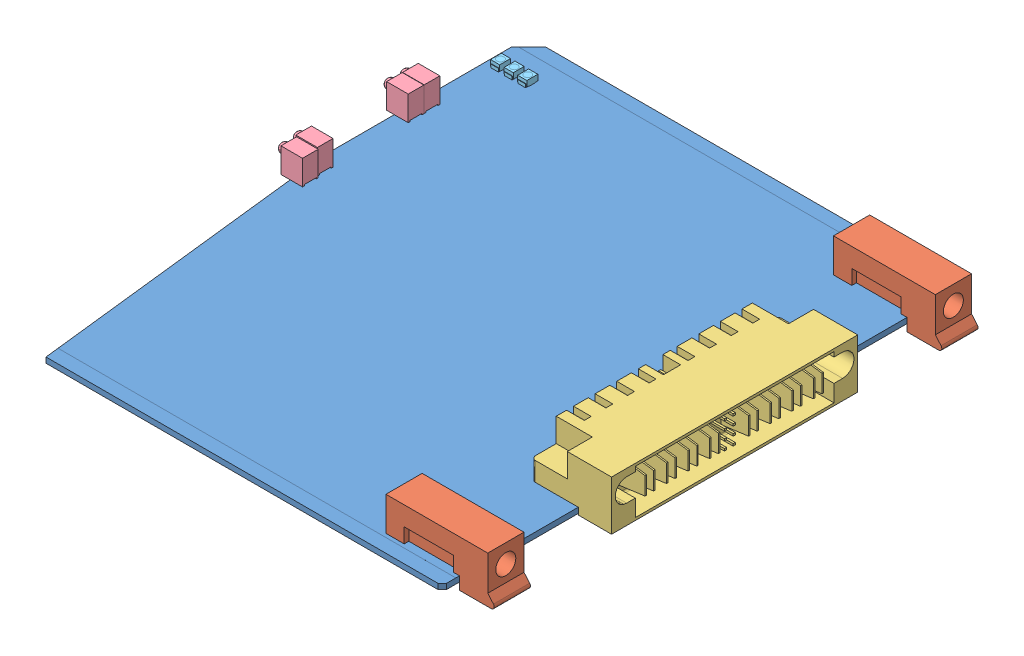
SolidWorks assembly pccpcb assy.SLDASM, configuration Default (file format 4400). Lengths in mm.
Overall size (141.88 16.57 152.4).
11 component instances, 5 part files, 17 mates.
Components (placement in the parent):
- PCB-pcc-1: PCB-pcc.SLDPRT [Default] at origin size (127 1.6 152.4)
- 10045597-1: 10045597.SLDPRT [Default] at (103.5 1.6 -65.775) x (0 0 -1) z (1 0 0) size (10.65 13.95 31.86)
- 10045597-5: 10045597.SLDPRT [Default] at (103.5 1.6 65.8263) x (0 0 -1) z (1 0 0) size (10.65 13.95 31.86)
- 51720-10400804AAC-1: 51720-10400804AAC.SLDPRT [Default] at (61.468 6.8832 32.0675) x (0 0 -1) z (1 0 0) size (72.39 16.51 23.62)
- WP934CB 2.9mm led -5: WP934CB 2.9mm led .SLDPRT [Default] at (-62.325 1.6 -12.05) x (0 0 1) z (-1 0 0) size (4.6 10.77 8.75)
- WP934CB 2.9mm led -6: WP934CB 2.9mm led .SLDPRT [Default] at (-61.7638 1.6 -7.1118) x (0 0 1) z (-1 0 0) size (4.6 10.77 8.75)
- WP934CB 2.9mm led -3: WP934CB 2.9mm led .SLDPRT [Default] at (-62.575 1.6 -39) x (0 0 1) z (-1 0 0) size (4.6 10.77 8.75)
- WP934CB 2.9mm led -4: WP934CB 2.9mm led .SLDPRT [Default] at (-62.575 1.6 -43.7) x (0 0 1) z (-1 0 0) size (4.6 10.77 8.75)
- C16643 (smd logo)-1: C16643 (smd logo).SLDPRT [Default] at (-60.15 1.6 -64.6) size (2.7 1.9 3.5)
- C16643 (smd logo)-2: C16643 (smd logo).SLDPRT [Default] at (-56.15 1.6 -64.6) size (2.7 1.9 3.5)
- C16643 (smd logo)-3: C16643 (smd logo).SLDPRT [Default] at (-52.15 1.6 -64.6) size (2.7 1.9 3.5)
Mates (geometry in assembly coordinates):
- Coincident8: coincident anti-aligned: plane of PCB-pcc-1 through (63.5 1.6 76.2) normal (0 1 0); plane of 10045597-1 through (41.4374 1.6 -60.257) normal (0 -1 0)
- Coincident26: coincident anti-aligned: plane of PCB-pcc-1 through (63.5 1.6 -76.2) normal (1 0 0); plane of 10045597-1 through (63.5 1.674 -60.257) normal (-1 0 0)
- Distance2: distance = 5.08 mm aligned: plane of 10045597-1 through (41.233 16.668 -71.12) normal (0 0 -1); plane of PCB-pcc-1 through (-63.5 1.6 -76.2) normal (0 0 -1)
- Coincident10: coincident anti-aligned: plane of PCB-pcc-1 through (63.5 1.6 76.2) normal (0 1 0); plane of 51720-10400804AAC-1 through (49.657 1.6 37.0205) normal (0 -1 0)
- Coincident25: coincident anti-aligned: plane of PCB-pcc-1 through (63.5 1.6 -76.2) normal (1 0 0); plane of 51720-10400804AAC-1 through (63.5 1.6 37.0205) normal (-1 0 0)
- Distance18: distance = 36.195 mm aligned: plane of 51720-10400804AAC-1 through (49.657 14.173 36.195) normal (0 0 1); plane of assembly through (0 0 0) normal (0 0 1)
- Coincident12: coincident anti-aligned: plane of PCB-pcc-1 through (63.5 1.6 76.2) normal (0 1 0); plane of WP934CB 2.9mm led -5 through (-65 1.6 -9.75) normal (0 -1 0)
- Distance5: distance = 2 mm aligned: plane of PCB-pcc-1 through (-63.5 1.6 -76.2) normal (-1 0 0); plane of WP934CB 2.9mm led -5 through (-65.5 8.9 -14.35) normal (-1 0 0)
- Distance4: distance = 85.95 mm aligned: plane of PCB-pcc-1 through (-63.5 1.6 76.2) normal (0 0 1); plane of WP934CB 2.9mm led -5 through (-59.15 8.9 -9.75) normal (0 0 1)
- Coincident15: coincident anti-aligned: plane of PCB-pcc-1 through (63.5 1.6 76.2) normal (0 1 0); plane of WP934CB 2.9mm led -3 through (-65.75 1.6 -36.7) normal (0 -1 0)
- Distance6: distance = 112.9 mm aligned: plane of WP934CB 2.9mm led -3 through (-59.4 8.9 -36.7) normal (0 0 1); plane of PCB-pcc-1 through (-63.5 1.6 76.2) normal (0 0 1)
- Distance7: distance = 2.25 mm aligned: plane of WP934CB 2.9mm led -3 through (-65.75 8.9 -41.3) normal (-1 0 0); plane of PCB-pcc-1 through (-63.5 1.6 -76.2) normal (-1 0 0)
- Coincident24: coincident anti-aligned: plane of PCB-pcc-1 through (63.5 1.6 76.2) normal (0 1 0); plane of C16643 (smd logo)-1 through (-58.8 1.6 -66.2) normal (0 -1 0)
- Distance16: distance = 2 mm aligned: plane of C16643 (smd logo)-1 through (-61.5 3.5 -63) normal (-1 0 0); plane of PCB-pcc-1 through (-63.5 1.6 -76.2) normal (-1 0 0)
- Distance17: distance = 10 mm aligned: plane of C16643 (smd logo)-1 through (-61.5 3.5 -66.2) normal (0 0 -1); plane of PCB-pcc-1 through (-63.5 1.6 -76.2) normal (0 0 -1)
- LocalLPattern2: unknown: line of PCB-pcc-1 through (-63.5 1.6 -71.2) axis (0 0 1)
- LocalLPattern3: unknown: line of PCB-pcc-1 through (62.23 1.5999 -76.2) axis (-1 0 0)
